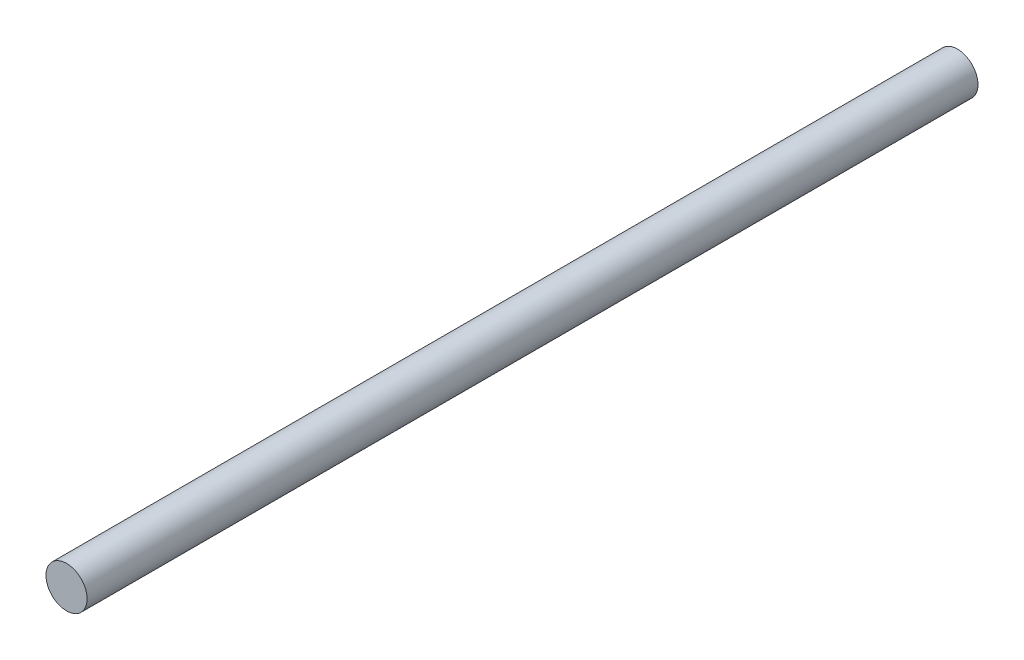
ISO-10303-21;
HEADER;
FILE_DESCRIPTION(('STEP AP214'),'2;1');
FILE_NAME('part.step','',(''),(''),'','','');
FILE_SCHEMA(('AUTOMOTIVE_DESIGN { 1 0 10303 214 1 1 1 1 }'));
ENDSEC;
DATA;
#1=APPLICATION_CONTEXT('core data for automotive mechanical design processes');
#2=APPLICATION_PROTOCOL_DEFINITION('international standard','automotive_design',2000,#1);
#3=PRODUCT_CONTEXT('',#1,'mechanical');
#4=PRODUCT('Part','Part','',(#3));
#5=PRODUCT_RELATED_PRODUCT_CATEGORY('part','',(#4));
#6=PRODUCT_DEFINITION_FORMATION('','',#4);
#7=PRODUCT_DEFINITION_CONTEXT('part definition',#1,'design');
#8=PRODUCT_DEFINITION('design','',#6,#7);
#9=PRODUCT_DEFINITION_SHAPE('','',#8);
#10=(LENGTH_UNIT() NAMED_UNIT(*) SI_UNIT(.MILLI.,.METRE.));
#11=(NAMED_UNIT(*) PLANE_ANGLE_UNIT() SI_UNIT($,.RADIAN.));
#12=(NAMED_UNIT(*) SI_UNIT($,.STERADIAN.) SOLID_ANGLE_UNIT());
#13=UNCERTAINTY_MEASURE_WITH_UNIT(LENGTH_MEASURE(1.E-05),#10,'distance_accuracy_value','');
#14=(GEOMETRIC_REPRESENTATION_CONTEXT(3) GLOBAL_UNCERTAINTY_ASSIGNED_CONTEXT((#13)) GLOBAL_UNIT_ASSIGNED_CONTEXT((#10,
#11,#12)) REPRESENTATION_CONTEXT('',''));
#15=CARTESIAN_POINT('',(0.,0.,0.));
#16=DIRECTION('',(0.,0.,1.));
#17=DIRECTION('',(1.,0.,0.));
#18=AXIS2_PLACEMENT_3D('',#15,#16,#17);
#19=CARTESIAN_POINT('',(0.,0.,137.45083));
#20=DIRECTION('',(0.,0.,-1.));
#21=DIRECTION('',(-1.,0.,0.));
#22=AXIS2_PLACEMENT_3D('',#19,#20,#21);
#23=CYLINDRICAL_SURFACE('',#22,6.35);
#24=CARTESIAN_POINT('',(0.,0.,137.45083));
#25=DIRECTION('',(0.,0.,1.));
#26=DIRECTION('',(1.,0.,0.));
#27=AXIS2_PLACEMENT_3D('',#24,#25,#26);
#28=CIRCLE('',#27,6.35);
#29=CARTESIAN_POINT('',(6.35,0.,137.45083));
#30=VERTEX_POINT('',#29);
#31=EDGE_CURVE('E10',#30,#30,#28,.T.);
#32=ORIENTED_EDGE('',*,*,#31,.F.);
#33=EDGE_LOOP('',(#32));
#34=FACE_BOUND('',#33,.T.);
#35=CARTESIAN_POINT('',(0.,0.,-137.45083));
#36=DIRECTION('',(0.,0.,1.));
#37=DIRECTION('',(1.,0.,0.));
#38=AXIS2_PLACEMENT_3D('',#35,#36,#37);
#39=CIRCLE('',#38,6.35);
#40=CARTESIAN_POINT('',(6.35,0.,-137.45083));
#41=VERTEX_POINT('',#40);
#42=EDGE_CURVE('E29',#41,#41,#39,.T.);
#43=ORIENTED_EDGE('',*,*,#42,.T.);
#44=EDGE_LOOP('',(#43));
#45=FACE_BOUND('',#44,.T.);
#46=ADVANCED_FACE('F26',(#34,#45),#23,.T.);
#47=CARTESIAN_POINT('',(0.,0.,137.45083));
#48=DIRECTION('',(0.,0.,1.));
#49=DIRECTION('',(1.,0.,0.));
#50=AXIS2_PLACEMENT_3D('',#47,#48,#49);
#51=PLANE('',#50);
#52=ORIENTED_EDGE('',*,*,#31,.T.);
#53=EDGE_LOOP('',(#52));
#54=FACE_BOUND('',#53,.T.);
#55=ADVANCED_FACE('F41',(#54),#51,.T.);
#56=CARTESIAN_POINT('',(0.,0.,-137.45083));
#57=DIRECTION('',(0.,0.,1.));
#58=DIRECTION('',(1.,0.,0.));
#59=AXIS2_PLACEMENT_3D('',#56,#57,#58);
#60=PLANE('',#59);
#61=ORIENTED_EDGE('',*,*,#42,.F.);
#62=EDGE_LOOP('',(#61));
#63=FACE_BOUND('',#62,.T.);
#64=ADVANCED_FACE('F39',(#63),#60,.F.);
#65=CLOSED_SHELL('',(#46,#55,#64));
#66=MANIFOLD_SOLID_BREP('B2',#65);
#67=ADVANCED_BREP_SHAPE_REPRESENTATION('',(#18,#66),#14);
#68=SHAPE_DEFINITION_REPRESENTATION(#9,#67);
ENDSEC;
END-ISO-10303-21;
